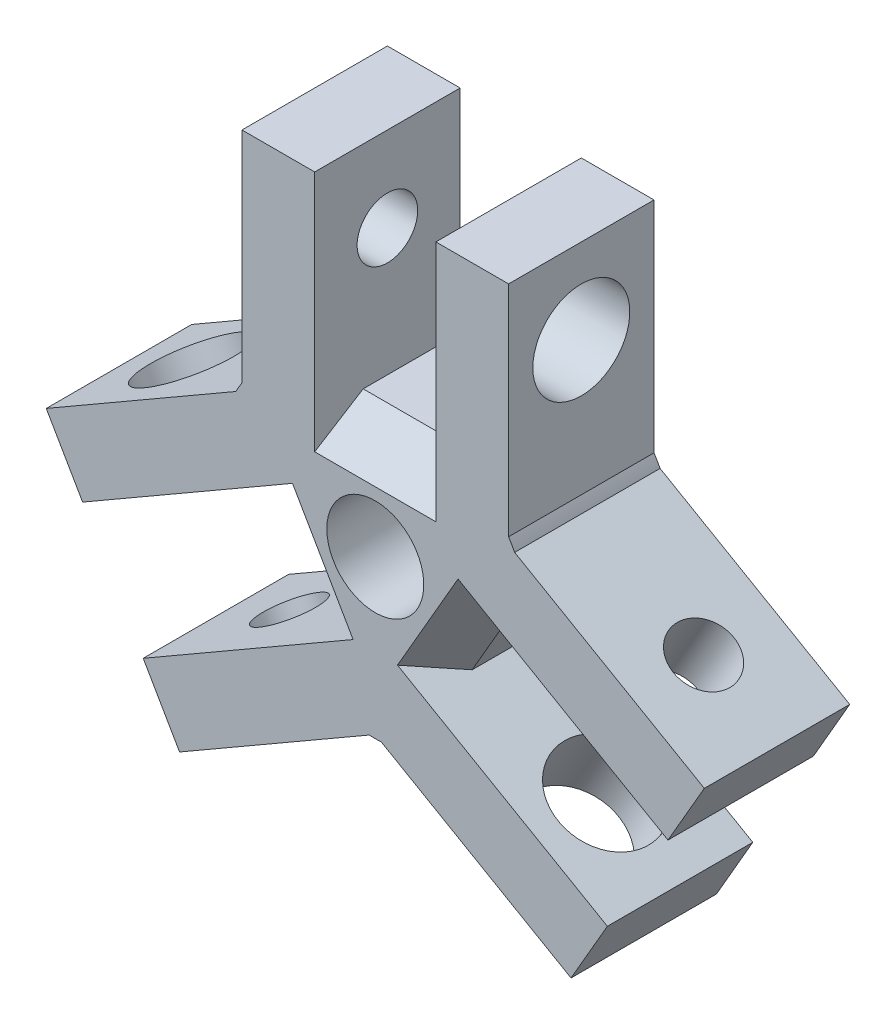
from build123d import *

# Parameters (mm, degrees)
SKETCH1_R                     = 6.5
EXTRUDE1_DEPTH                = 6
SKETCH3_W                     = 11
SKETCH3_H                     = 9.035898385
EXTRUDE2_DEPTH                = 6
SKETCH5_W                     = 5
SKETCH5_H                     = 8.75
CUT_EXTRUDE1_DEPTH            = 16.313392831
CHAMFER1_SIZE                 = 1.25
CHAMFER1_SIZE2                = 2
SKETCH4_R                     = 1.25
CUT_EXTRUDE11_DEPTH           = 18.948226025
SKETCH51_R                    = 2
CUT_EXTRUDE2_DEPTH            = 18.948226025
CIRPATTERN1_COUNT             = 3
CHAMFER1_OF_CIRPATTERN1_SIZE2 = 2
CHAMFER1_OF_CIRPATTERN1_SIZE  = 1.25
M4X0_7_TAPPED_HOLE1_D         = 4


with BuildPart() as part:
    # Sketch1 → Extrude1 (new body)
    with BuildSketch(Plane.XY):
        Circle(SKETCH1_R)
    extrude(amount=EXTRUDE1_DEPTH)

    # Sketch3 → Extrude2 (add)
    with BuildSketch(Plane.XY):
        with Locations((0, 7.982050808)):
            Rectangle(SKETCH3_W, SKETCH3_H)
    extrude2 = extrude(amount=EXTRUDE2_DEPTH)

    # Sketch5 → Cut-Extrude1 (cut, through all)
    with BuildSketch(Plane.XY):
        with Locations((0, 8.125)):
            Rectangle(SKETCH5_W, SKETCH5_H)
    cut_extrude1 = extrude(amount=CUT_EXTRUDE1_DEPTH, mode=Mode.SUBTRACT)

    # Chamfer1
    chamfer1_edges = [part.edges().sort_by_distance(p)[0] for p in [
        (0, 3.75, 6),
    ]]
    chamfer1_side = [part.faces().sort_by_distance(p)[0] for p in [
        (0, 1.984027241, 6),
    ]]
    chamfer(chamfer1_edges, length=CHAMFER1_SIZE, length2=CHAMFER1_SIZE2, reference=chamfer1_side[0])

    # Sketch4 → Cut-Extrude11 (cut, symmetric)
    with BuildSketch(Plane(origin=(-2.5, 8.707604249, 2.858727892), x_dir=(0, 0, -1), z_dir=(1, 0, 0))):
        with Locations(Location((-0.141272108, 0.292395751, 0), (0, 0, 180))):
            Circle(SKETCH4_R)
    cut_extrude11 = extrude(amount=CUT_EXTRUDE11_DEPTH, both=True, mode=Mode.SUBTRACT)

    # Sketch51 → Cut-Extrude2 (cut, through all)
    with BuildSketch(Plane(origin=(-2.5, 8.707604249, 2.858727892), x_dir=(0, 0, -1), z_dir=(1, 0, 0))):
        with Locations(Location((-0.141272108, 0.292395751, 0), (0, 0, 270))):
            Circle(SKETCH51_R)
    cut_extrude2 = extrude(amount=CUT_EXTRUDE2_DEPTH, mode=Mode.SUBTRACT)

    # CirPattern1: Extrude2, Cut-Extrude1, Cut-Extrude11, Cut-Extrude2 ×3 about axis
    cirpattern1_axis = Axis((0, 0, 0), (0, 0, 1))
    add([extrude2.rotate(cirpattern1_axis, i * 360 / CIRPATTERN1_COUNT) for i in range(1, CIRPATTERN1_COUNT)])
    add([cut_extrude1.rotate(cirpattern1_axis, i * 360 / CIRPATTERN1_COUNT) for i in range(1, CIRPATTERN1_COUNT)], mode=Mode.SUBTRACT)
    add([cut_extrude11.rotate(cirpattern1_axis, i * 360 / CIRPATTERN1_COUNT) for i in range(1, CIRPATTERN1_COUNT)], mode=Mode.SUBTRACT)
    add([cut_extrude2.rotate(cirpattern1_axis, i * 360 / CIRPATTERN1_COUNT) for i in range(1, CIRPATTERN1_COUNT)], mode=Mode.SUBTRACT)

    # Chamfer1 of CirPattern1
    chamfer1_of_cirpattern1_edges = [part.edges().sort_by_distance(p)[0] for p in [
        (-3.247595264, -1.875, 6),
        (3.247595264, -1.875, 6),
    ]]
    chamfer(chamfer1_of_cirpattern1_edges, length=CHAMFER1_OF_CIRPATTERN1_SIZE, length2=CHAMFER1_OF_CIRPATTERN1_SIZE2)

    # M4x0.7 Tapped Hole1 (through all)
    with Locations(Plane(origin=(0, 0, 0), x_dir=(-1, 0, 0), z_dir=(0, 0, -1))):
        with Locations((0, 0)):
            Hole(M4X0_7_TAPPED_HOLE1_D / 2)


solid = part.part
